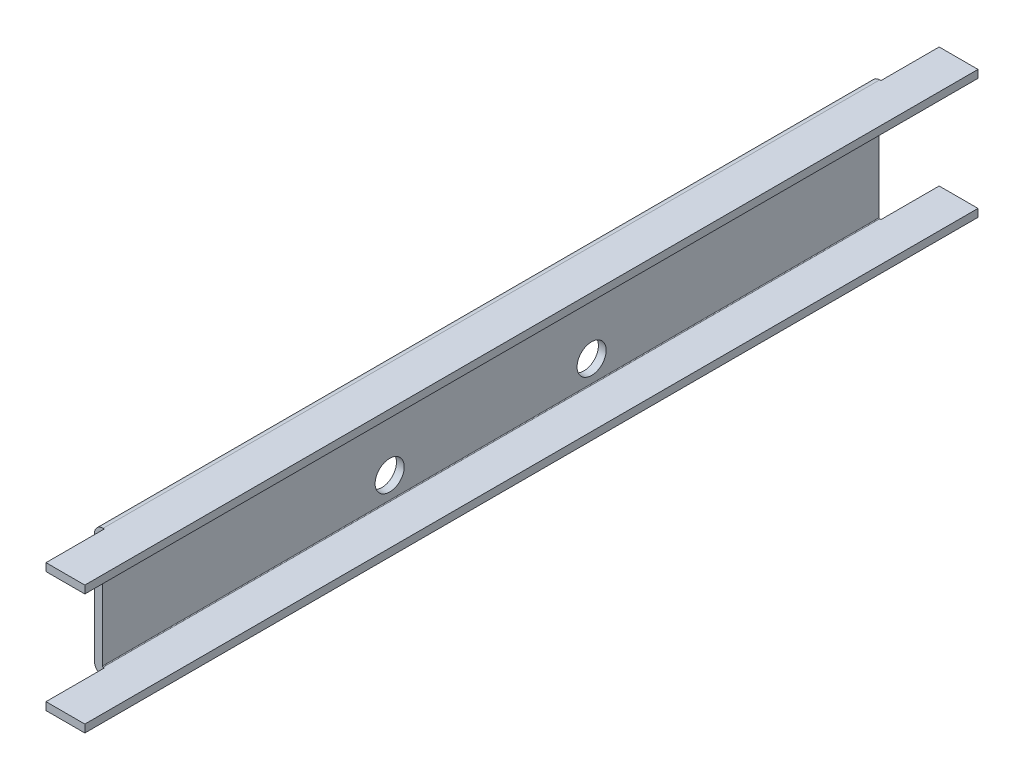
ISO-10303-21;
HEADER;
FILE_DESCRIPTION(('STEP AP214'),'2;1');
FILE_NAME('part.step','',(''),(''),'','','');
FILE_SCHEMA(('AUTOMOTIVE_DESIGN { 1 0 10303 214 1 1 1 1 }'));
ENDSEC;
DATA;
#1=APPLICATION_CONTEXT('core data for automotive mechanical design processes');
#2=APPLICATION_PROTOCOL_DEFINITION('international standard','automotive_design',2000,#1);
#3=PRODUCT_CONTEXT('',#1,'mechanical');
#4=PRODUCT('Part','Part','',(#3));
#5=PRODUCT_RELATED_PRODUCT_CATEGORY('part','',(#4));
#6=PRODUCT_DEFINITION_FORMATION('','',#4);
#7=PRODUCT_DEFINITION_CONTEXT('part definition',#1,'design');
#8=PRODUCT_DEFINITION('design','',#6,#7);
#9=PRODUCT_DEFINITION_SHAPE('','',#8);
#10=(LENGTH_UNIT() NAMED_UNIT(*) SI_UNIT(.MILLI.,.METRE.));
#11=(NAMED_UNIT(*) PLANE_ANGLE_UNIT() SI_UNIT($,.RADIAN.));
#12=(NAMED_UNIT(*) SI_UNIT($,.STERADIAN.) SOLID_ANGLE_UNIT());
#13=UNCERTAINTY_MEASURE_WITH_UNIT(LENGTH_MEASURE(1.E-05),#10,'distance_accuracy_value','');
#14=(GEOMETRIC_REPRESENTATION_CONTEXT(3) GLOBAL_UNCERTAINTY_ASSIGNED_CONTEXT((#13)) GLOBAL_UNIT_ASSIGNED_CONTEXT((#10,
#11,#12)) REPRESENTATION_CONTEXT('',''));
#15=CARTESIAN_POINT('',(0.,0.,0.));
#16=DIRECTION('',(0.,0.,1.));
#17=DIRECTION('',(1.,0.,0.));
#18=AXIS2_PLACEMENT_3D('',#15,#16,#17);
#19=CARTESIAN_POINT('',(-8.,57.2634,-460.));
#20=DIRECTION('',(0.,0.,-1.));
#21=DIRECTION('',(-1.,0.,0.));
#22=AXIS2_PLACEMENT_3D('',#19,#20,#21);
#23=PLANE('',#22);
#24=DIRECTION('',(-1.,0.,0.));
#25=VECTOR('',#24,1.);
#26=CARTESIAN_POINT('',(42.,58.,-460.));
#27=LINE('',#26,#25);
#28=CARTESIAN_POINT('',(42.,58.,-460.));
#29=VERTEX_POINT('',#28);
#30=CARTESIAN_POINT('',(2.,58.,-460.));
#31=VERTEX_POINT('',#30);
#32=EDGE_CURVE('E288',#29,#31,#27,.T.);
#33=ORIENTED_EDGE('',*,*,#32,.T.);
#34=DIRECTION('',(0.,1.,0.));
#35=VECTOR('',#34,1.);
#36=CARTESIAN_POINT('',(2.,57.2634,-460.));
#37=LINE('',#36,#35);
#38=CARTESIAN_POINT('',(2.,66.,-460.));
#39=VERTEX_POINT('',#38);
#40=EDGE_CURVE('E207',#31,#39,#37,.T.);
#41=ORIENTED_EDGE('',*,*,#40,.T.);
#42=DIRECTION('',(-1.,0.,0.));
#43=VECTOR('',#42,1.);
#44=CARTESIAN_POINT('',(42.,66.,-460.));
#45=LINE('',#44,#43);
#46=CARTESIAN_POINT('',(42.,66.,-460.));
#47=VERTEX_POINT('',#46);
#48=EDGE_CURVE('E294',#47,#39,#45,.T.);
#49=ORIENTED_EDGE('',*,*,#48,.F.);
#50=DIRECTION('',(0.,-1.,0.));
#51=VECTOR('',#50,1.);
#52=CARTESIAN_POINT('',(42.,66.,-460.));
#53=LINE('',#52,#51);
#54=EDGE_CURVE('E291',#47,#29,#53,.T.);
#55=ORIENTED_EDGE('',*,*,#54,.T.);
#56=EDGE_LOOP('',(#33,#41,#49,#55));
#57=FACE_BOUND('',#56,.T.);
#58=ADVANCED_FACE('F43',(#57),#23,.T.);
#59=CARTESIAN_POINT('',(0.736600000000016,-57.2634,-460.));
#60=DIRECTION('',(0.,0.,-1.));
#61=DIRECTION('',(-1.,0.,0.));
#62=AXIS2_PLACEMENT_3D('',#59,#60,#61);
#63=PLANE('',#62);
#64=DIRECTION('',(1.,0.,0.));
#65=VECTOR('',#64,1.);
#66=CARTESIAN_POINT('',(0.,-66.,-460.));
#67=LINE('',#66,#65);
#68=CARTESIAN_POINT('',(2.00000000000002,-66.,-460.));
#69=VERTEX_POINT('',#68);
#70=CARTESIAN_POINT('',(42.,-66.,-460.));
#71=VERTEX_POINT('',#70);
#72=EDGE_CURVE('E281',#69,#71,#67,.T.);
#73=ORIENTED_EDGE('',*,*,#72,.F.);
#74=DIRECTION('',(0.,1.,0.));
#75=VECTOR('',#74,1.);
#76=CARTESIAN_POINT('',(2.00000000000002,-57.2634,-460.));
#77=LINE('',#76,#75);
#78=CARTESIAN_POINT('',(2.00000000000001,-58.,-460.));
#79=VERTEX_POINT('',#78);
#80=EDGE_CURVE('E50',#69,#79,#77,.T.);
#81=ORIENTED_EDGE('',*,*,#80,.T.);
#82=DIRECTION('',(1.,0.,0.));
#83=VECTOR('',#82,1.);
#84=CARTESIAN_POINT('',(0.,-58.,-460.));
#85=LINE('',#84,#83);
#86=CARTESIAN_POINT('',(42.,-58.,-460.));
#87=VERTEX_POINT('',#86);
#88=EDGE_CURVE('E286',#79,#87,#85,.T.);
#89=ORIENTED_EDGE('',*,*,#88,.T.);
#90=DIRECTION('',(0.,-1.,0.));
#91=VECTOR('',#90,1.);
#92=CARTESIAN_POINT('',(42.,-58.,-460.));
#93=LINE('',#92,#91);
#94=EDGE_CURVE('E283',#87,#71,#93,.T.);
#95=ORIENTED_EDGE('',*,*,#94,.T.);
#96=EDGE_LOOP('',(#73,#81,#89,#95));
#97=FACE_BOUND('',#96,.T.);
#98=ADVANCED_FACE('F351',(#97),#63,.T.);
#99=CARTESIAN_POINT('',(-7.99999999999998,-57.2633999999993,460.));
#100=DIRECTION('',(0.,0.,1.));
#101=DIRECTION('',(1.,0.,0.));
#102=AXIS2_PLACEMENT_3D('',#99,#100,#101);
#103=PLANE('',#102);
#104=DIRECTION('',(0.,1.,0.));
#105=VECTOR('',#104,1.);
#106=CARTESIAN_POINT('',(2.00000000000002,-57.2633999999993,460.));
#107=LINE('',#106,#105);
#108=CARTESIAN_POINT('',(2.00000000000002,-66.,460.));
#109=VERTEX_POINT('',#108);
#110=CARTESIAN_POINT('',(2.00000000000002,-58.,460.));
#111=VERTEX_POINT('',#110);
#112=EDGE_CURVE('E234',#109,#111,#107,.T.);
#113=ORIENTED_EDGE('',*,*,#112,.F.);
#114=DIRECTION('',(1.,0.,0.));
#115=VECTOR('',#114,1.);
#116=CARTESIAN_POINT('',(0.,-66.,460.));
#117=LINE('',#116,#115);
#118=CARTESIAN_POINT('',(42.,-66.,460.));
#119=VERTEX_POINT('',#118);
#120=EDGE_CURVE('E297',#109,#119,#117,.T.);
#121=ORIENTED_EDGE('',*,*,#120,.T.);
#122=DIRECTION('',(0.,-1.,0.));
#123=VECTOR('',#122,1.);
#124=CARTESIAN_POINT('',(42.,-58.,460.));
#125=LINE('',#124,#123);
#126=CARTESIAN_POINT('',(42.,-58.,460.));
#127=VERTEX_POINT('',#126);
#128=EDGE_CURVE('E299',#127,#119,#125,.T.);
#129=ORIENTED_EDGE('',*,*,#128,.F.);
#130=DIRECTION('',(1.,0.,0.));
#131=VECTOR('',#130,1.);
#132=CARTESIAN_POINT('',(0.,-58.,460.));
#133=LINE('',#132,#131);
#134=EDGE_CURVE('E302',#111,#127,#133,.T.);
#135=ORIENTED_EDGE('',*,*,#134,.F.);
#136=EDGE_LOOP('',(#113,#121,#129,#135));
#137=FACE_BOUND('',#136,.T.);
#138=ADVANCED_FACE('F365',(#137),#103,.T.);
#139=CARTESIAN_POINT('',(0.,-66.,460.));
#140=DIRECTION('',(0.,1.,0.));
#141=DIRECTION('',(0.,0.,1.));
#142=AXIS2_PLACEMENT_3D('',#139,#140,#141);
#143=PLANE('',#142);
#144=DIRECTION('',(0.,0.,-1.));
#145=VECTOR('',#144,1.);
#146=CARTESIAN_POINT('',(0.736600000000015,-66.,460.));
#147=LINE('',#146,#145);
#148=CARTESIAN_POINT('',(0.736600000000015,-66.,400.));
#149=VERTEX_POINT('',#148);
#150=CARTESIAN_POINT('',(0.736600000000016,-66.,-400.));
#151=VERTEX_POINT('',#150);
#152=EDGE_CURVE('E199',#149,#151,#147,.T.);
#153=ORIENTED_EDGE('',*,*,#152,.T.);
#154=DIRECTION('',(1.,0.,0.));
#155=VECTOR('',#154,1.);
#156=CARTESIAN_POINT('',(0.,-66.,-400.));
#157=LINE('',#156,#155);
#158=CARTESIAN_POINT('',(2.00000000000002,-66.,-400.));
#159=VERTEX_POINT('',#158);
#160=EDGE_CURVE('E190',#151,#159,#157,.T.);
#161=ORIENTED_EDGE('',*,*,#160,.T.);
#162=DIRECTION('',(0.,0.,1.));
#163=VECTOR('',#162,1.);
#164=CARTESIAN_POINT('',(2.00000000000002,-66.,460.));
#165=LINE('',#164,#163);
#166=EDGE_CURVE('E179',#69,#159,#165,.T.);
#167=ORIENTED_EDGE('',*,*,#166,.F.);
#168=ORIENTED_EDGE('',*,*,#72,.T.);
#169=DIRECTION('',(0.,0.,-1.));
#170=VECTOR('',#169,1.);
#171=CARTESIAN_POINT('',(42.,-66.,460.));
#172=LINE('',#171,#170);
#173=EDGE_CURVE('E342',#119,#71,#172,.T.);
#174=ORIENTED_EDGE('',*,*,#173,.F.);
#175=ORIENTED_EDGE('',*,*,#120,.F.);
#176=DIRECTION('',(0.,0.,-1.));
#177=VECTOR('',#176,1.);
#178=CARTESIAN_POINT('',(2.00000000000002,-66.,460.));
#179=LINE('',#178,#177);
#180=CARTESIAN_POINT('',(2.00000000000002,-66.,400.));
#181=VERTEX_POINT('',#180);
#182=EDGE_CURVE('E236',#109,#181,#179,.T.);
#183=ORIENTED_EDGE('',*,*,#182,.T.);
#184=DIRECTION('',(-1.,0.,0.));
#185=VECTOR('',#184,1.);
#186=CARTESIAN_POINT('',(0.,-66.,400.));
#187=LINE('',#186,#185);
#188=EDGE_CURVE('E239',#181,#149,#187,.T.);
#189=ORIENTED_EDGE('',*,*,#188,.T.);
#190=EDGE_LOOP('',(#153,#161,#167,#168,#174,#175,#183,#189));
#191=FACE_BOUND('',#190,.T.);
#192=ADVANCED_FACE('F196',(#191),#143,.F.);
#193=CARTESIAN_POINT('',(42.,-58.,460.));
#194=DIRECTION('',(1.,0.,0.));
#195=DIRECTION('',(0.,0.,-1.));
#196=AXIS2_PLACEMENT_3D('',#193,#194,#195);
#197=PLANE('',#196);
#198=ORIENTED_EDGE('',*,*,#94,.F.);
#199=DIRECTION('',(0.,0.,-1.));
#200=VECTOR('',#199,1.);
#201=CARTESIAN_POINT('',(42.,-58.,460.));
#202=LINE('',#201,#200);
#203=EDGE_CURVE('E339',#127,#87,#202,.T.);
#204=ORIENTED_EDGE('',*,*,#203,.F.);
#205=ORIENTED_EDGE('',*,*,#128,.T.);
#206=ORIENTED_EDGE('',*,*,#173,.T.);
#207=EDGE_LOOP('',(#198,#204,#205,#206));
#208=FACE_BOUND('',#207,.T.);
#209=ADVANCED_FACE('F360',(#208),#197,.T.);
#210=CARTESIAN_POINT('',(0.,-58.,460.));
#211=DIRECTION('',(0.,1.,0.));
#212=DIRECTION('',(0.,0.,1.));
#213=AXIS2_PLACEMENT_3D('',#210,#211,#212);
#214=PLANE('',#213);
#215=DIRECTION('',(1.,0.,0.));
#216=VECTOR('',#215,1.);
#217=CARTESIAN_POINT('',(0.,-58.,-400.));
#218=LINE('',#217,#216);
#219=CARTESIAN_POINT('',(0.736600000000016,-58.,-400.));
#220=VERTEX_POINT('',#219);
#221=CARTESIAN_POINT('',(2.00000000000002,-58.,-400.));
#222=VERTEX_POINT('',#221);
#223=EDGE_CURVE('E192',#220,#222,#218,.T.);
#224=ORIENTED_EDGE('',*,*,#223,.F.);
#225=DIRECTION('',(0.,0.,-1.));
#226=VECTOR('',#225,1.);
#227=CARTESIAN_POINT('',(0.736600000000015,-58.,460.));
#228=LINE('',#227,#226);
#229=CARTESIAN_POINT('',(0.736600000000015,-58.,400.));
#230=VERTEX_POINT('',#229);
#231=EDGE_CURVE('E336',#230,#220,#228,.T.);
#232=ORIENTED_EDGE('',*,*,#231,.F.);
#233=DIRECTION('',(-1.,0.,0.));
#234=VECTOR('',#233,1.);
#235=CARTESIAN_POINT('',(0.,-58.,400.));
#236=LINE('',#235,#234);
#237=CARTESIAN_POINT('',(2.00000000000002,-58.,400.));
#238=VERTEX_POINT('',#237);
#239=EDGE_CURVE('E255',#238,#230,#236,.T.);
#240=ORIENTED_EDGE('',*,*,#239,.F.);
#241=DIRECTION('',(0.,0.,-1.));
#242=VECTOR('',#241,1.);
#243=CARTESIAN_POINT('',(2.00000000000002,-58.,460.));
#244=LINE('',#243,#242);
#245=EDGE_CURVE('E232',#111,#238,#244,.T.);
#246=ORIENTED_EDGE('',*,*,#245,.F.);
#247=ORIENTED_EDGE('',*,*,#134,.T.);
#248=ORIENTED_EDGE('',*,*,#203,.T.);
#249=ORIENTED_EDGE('',*,*,#88,.F.);
#250=DIRECTION('',(0.,0.,1.));
#251=VECTOR('',#250,1.);
#252=CARTESIAN_POINT('',(2.00000000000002,-58.,460.));
#253=LINE('',#252,#251);
#254=EDGE_CURVE('E57',#79,#222,#253,.T.);
#255=ORIENTED_EDGE('',*,*,#254,.T.);
#256=EDGE_LOOP('',(#224,#232,#240,#246,#247,#248,#249,#255));
#257=FACE_BOUND('',#256,.T.);
#258=ADVANCED_FACE('F353',(#257),#214,.T.);
#259=CARTESIAN_POINT('',(0.736600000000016,-57.2634,460.));
#260=DIRECTION('',(0.,0.,-1.));
#261=DIRECTION('',(-1.,0.,0.));
#262=AXIS2_PLACEMENT_3D('',#259,#260,#261);
#263=CYLINDRICAL_SURFACE('',#262,0.7366);
#264=CARTESIAN_POINT('',(0.736600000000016,-57.2634,-400.));
#265=DIRECTION('',(0.,0.,1.));
#266=DIRECTION('',(0.,-1.,0.));
#267=AXIS2_PLACEMENT_3D('',#264,#265,#266);
#268=CIRCLE('',#267,0.7366);
#269=CARTESIAN_POINT('',(0.,-57.2633999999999,-400.));
#270=VERTEX_POINT('',#269);
#271=EDGE_CURVE('E219',#270,#220,#268,.T.);
#272=ORIENTED_EDGE('',*,*,#271,.F.);
#273=DIRECTION('',(0.,0.,-1.));
#274=VECTOR('',#273,1.);
#275=CARTESIAN_POINT('',(0.,-57.2633999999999,460.));
#276=LINE('',#275,#274);
#277=CARTESIAN_POINT('',(0.,-57.2633999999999,400.));
#278=VERTEX_POINT('',#277);
#279=EDGE_CURVE('E333',#278,#270,#276,.T.);
#280=ORIENTED_EDGE('',*,*,#279,.F.);
#281=CARTESIAN_POINT('',(0.736600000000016,-57.2634,400.));
#282=DIRECTION('',(0.,0.,-1.));
#283=DIRECTION('',(0.,1.,0.));
#284=AXIS2_PLACEMENT_3D('',#281,#282,#283);
#285=CIRCLE('',#284,0.7366);
#286=EDGE_CURVE('E253',#230,#278,#285,.T.);
#287=ORIENTED_EDGE('',*,*,#286,.F.);
#288=ORIENTED_EDGE('',*,*,#231,.T.);
#289=EDGE_LOOP('',(#272,#280,#287,#288));
#290=FACE_BOUND('',#289,.T.);
#291=ADVANCED_FACE('F378',(#290),#263,.F.);
#292=CARTESIAN_POINT('',(0.,58.,460.));
#293=DIRECTION('',(1.,0.,0.));
#294=DIRECTION('',(0.,1.,0.));
#295=AXIS2_PLACEMENT_3D('',#292,#293,#294);
#296=PLANE('',#295);
#297=DIRECTION('',(0.,-1.,0.));
#298=VECTOR('',#297,1.);
#299=CARTESIAN_POINT('',(0.,57.9999999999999,-400.));
#300=LINE('',#299,#298);
#301=CARTESIAN_POINT('',(0.,57.2634,-400.));
#302=VERTEX_POINT('',#301);
#303=EDGE_CURVE('E217',#302,#270,#300,.T.);
#304=ORIENTED_EDGE('',*,*,#303,.F.);
#305=DIRECTION('',(0.,0.,-1.));
#306=VECTOR('',#305,1.);
#307=CARTESIAN_POINT('',(0.,57.2634,460.));
#308=LINE('',#307,#306);
#309=CARTESIAN_POINT('',(0.,57.2634,400.));
#310=VERTEX_POINT('',#309);
#311=EDGE_CURVE('E330',#310,#302,#308,.T.);
#312=ORIENTED_EDGE('',*,*,#311,.F.);
#313=DIRECTION('',(0.,1.,0.));
#314=VECTOR('',#313,1.);
#315=CARTESIAN_POINT('',(0.,58.,400.));
#316=LINE('',#315,#314);
#317=EDGE_CURVE('E251',#278,#310,#316,.T.);
#318=ORIENTED_EDGE('',*,*,#317,.F.);
#319=ORIENTED_EDGE('',*,*,#279,.T.);
#320=EDGE_LOOP('',(#304,#312,#318,#319));
#321=FACE_BOUND('',#320,.T.);
#322=CARTESIAN_POINT('',(0.,-35.0000000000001,-104.));
#323=DIRECTION('',(1.,0.,0.));
#324=DIRECTION('',(0.,1.,0.));
#325=AXIS2_PLACEMENT_3D('',#322,#323,#324);
#326=CIRCLE('',#325,15.);
#327=CARTESIAN_POINT('',(0.,-20.0000000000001,-104.));
#328=VERTEX_POINT('',#327);
#329=EDGE_CURVE('E260',#328,#328,#326,.T.);
#330=ORIENTED_EDGE('',*,*,#329,.F.);
#331=EDGE_LOOP('',(#330));
#332=FACE_BOUND('',#331,.T.);
#333=CARTESIAN_POINT('',(0.,35.,-104.));
#334=DIRECTION('',(1.,0.,0.));
#335=DIRECTION('',(0.,1.,0.));
#336=AXIS2_PLACEMENT_3D('',#333,#334,#335);
#337=CIRCLE('',#336,15.);
#338=CARTESIAN_POINT('',(0.,50.,-104.));
#339=VERTEX_POINT('',#338);
#340=EDGE_CURVE('E266',#339,#339,#337,.T.);
#341=ORIENTED_EDGE('',*,*,#340,.F.);
#342=EDGE_LOOP('',(#341));
#343=FACE_BOUND('',#342,.T.);
#344=CARTESIAN_POINT('',(0.,-35.,104.));
#345=DIRECTION('',(1.,0.,0.));
#346=DIRECTION('',(0.,1.,0.));
#347=AXIS2_PLACEMENT_3D('',#344,#345,#346);
#348=CIRCLE('',#347,15.);
#349=CARTESIAN_POINT('',(0.,-20.,104.));
#350=VERTEX_POINT('',#349);
#351=EDGE_CURVE('E272',#350,#350,#348,.T.);
#352=ORIENTED_EDGE('',*,*,#351,.F.);
#353=EDGE_LOOP('',(#352));
#354=FACE_BOUND('',#353,.T.);
#355=CARTESIAN_POINT('',(0.,35.,104.));
#356=DIRECTION('',(1.,0.,0.));
#357=DIRECTION('',(0.,1.,0.));
#358=AXIS2_PLACEMENT_3D('',#355,#356,#357);
#359=CIRCLE('',#358,15.);
#360=CARTESIAN_POINT('',(0.,50.,104.));
#361=VERTEX_POINT('',#360);
#362=EDGE_CURVE('E278',#361,#361,#359,.T.);
#363=ORIENTED_EDGE('',*,*,#362,.F.);
#364=EDGE_LOOP('',(#363));
#365=FACE_BOUND('',#364,.T.);
#366=ADVANCED_FACE('F381',(#321,#332,#343,#354,#365),#296,.T.);
#367=CARTESIAN_POINT('',(0.73660000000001,57.2634,460.));
#368=DIRECTION('',(0.,0.,-1.));
#369=DIRECTION('',(-1.,0.,0.));
#370=AXIS2_PLACEMENT_3D('',#367,#368,#369);
#371=CYLINDRICAL_SURFACE('',#370,0.7366);
#372=CARTESIAN_POINT('',(0.73660000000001,57.2634,-400.));
#373=DIRECTION('',(0.,0.,1.));
#374=DIRECTION('',(0.,-1.,0.));
#375=AXIS2_PLACEMENT_3D('',#372,#373,#374);
#376=CIRCLE('',#375,0.7366);
#377=CARTESIAN_POINT('',(0.736600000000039,58.,-400.));
#378=VERTEX_POINT('',#377);
#379=EDGE_CURVE('E215',#378,#302,#376,.T.);
#380=ORIENTED_EDGE('',*,*,#379,.F.);
#381=DIRECTION('',(0.,0.,-1.));
#382=VECTOR('',#381,1.);
#383=CARTESIAN_POINT('',(0.736600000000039,58.,460.));
#384=LINE('',#383,#382);
#385=CARTESIAN_POINT('',(0.736600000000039,58.,400.));
#386=VERTEX_POINT('',#385);
#387=EDGE_CURVE('E327',#386,#378,#384,.T.);
#388=ORIENTED_EDGE('',*,*,#387,.F.);
#389=CARTESIAN_POINT('',(0.73660000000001,57.2634,400.));
#390=DIRECTION('',(0.,0.,-1.));
#391=DIRECTION('',(0.,1.,0.));
#392=AXIS2_PLACEMENT_3D('',#389,#390,#391);
#393=CIRCLE('',#392,0.7366);
#394=EDGE_CURVE('E249',#310,#386,#393,.T.);
#395=ORIENTED_EDGE('',*,*,#394,.F.);
#396=ORIENTED_EDGE('',*,*,#311,.T.);
#397=EDGE_LOOP('',(#380,#388,#395,#396));
#398=FACE_BOUND('',#397,.T.);
#399=ADVANCED_FACE('F389',(#398),#371,.F.);
#400=CARTESIAN_POINT('',(42.,58.,460.));
#401=DIRECTION('',(0.,-1.,0.));
#402=DIRECTION('',(1.,0.,0.));
#403=AXIS2_PLACEMENT_3D('',#400,#401,#402);
#404=PLANE('',#403);
#405=DIRECTION('',(-1.,0.,0.));
#406=VECTOR('',#405,1.);
#407=CARTESIAN_POINT('',(42.,58.,-400.));
#408=LINE('',#407,#406);
#409=CARTESIAN_POINT('',(2.,58.,-400.));
#410=VERTEX_POINT('',#409);
#411=EDGE_CURVE('E213',#410,#378,#408,.T.);
#412=ORIENTED_EDGE('',*,*,#411,.F.);
#413=DIRECTION('',(0.,0.,-1.));
#414=VECTOR('',#413,1.);
#415=CARTESIAN_POINT('',(2.,58.,460.));
#416=LINE('',#415,#414);
#417=EDGE_CURVE('E201',#410,#31,#416,.T.);
#418=ORIENTED_EDGE('',*,*,#417,.T.);
#419=ORIENTED_EDGE('',*,*,#32,.F.);
#420=DIRECTION('',(0.,0.,-1.));
#421=VECTOR('',#420,1.);
#422=CARTESIAN_POINT('',(42.,58.,460.));
#423=LINE('',#422,#421);
#424=CARTESIAN_POINT('',(42.,58.,460.));
#425=VERTEX_POINT('',#424);
#426=EDGE_CURVE('E325',#425,#29,#423,.T.);
#427=ORIENTED_EDGE('',*,*,#426,.F.);
#428=DIRECTION('',(-1.,0.,0.));
#429=VECTOR('',#428,1.);
#430=CARTESIAN_POINT('',(42.,58.,460.));
#431=LINE('',#430,#429);
#432=CARTESIAN_POINT('',(2.00000000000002,58.,460.));
#433=VERTEX_POINT('',#432);
#434=EDGE_CURVE('E304',#425,#433,#431,.T.);
#435=ORIENTED_EDGE('',*,*,#434,.T.);
#436=DIRECTION('',(0.,0.,1.));
#437=VECTOR('',#436,1.);
#438=CARTESIAN_POINT('',(2.,58.,460.));
#439=LINE('',#438,#437);
#440=CARTESIAN_POINT('',(2.,58.,400.));
#441=VERTEX_POINT('',#440);
#442=EDGE_CURVE('E65',#441,#433,#439,.T.);
#443=ORIENTED_EDGE('',*,*,#442,.F.);
#444=DIRECTION('',(1.,0.,0.));
#445=VECTOR('',#444,1.);
#446=CARTESIAN_POINT('',(42.,58.,400.));
#447=LINE('',#446,#445);
#448=EDGE_CURVE('E247',#386,#441,#447,.T.);
#449=ORIENTED_EDGE('',*,*,#448,.F.);
#450=ORIENTED_EDGE('',*,*,#387,.T.);
#451=EDGE_LOOP('',(#412,#418,#419,#427,#435,#443,#449,#450));
#452=FACE_BOUND('',#451,.T.);
#453=ADVANCED_FACE('F392',(#452),#404,.T.);
#454=CARTESIAN_POINT('',(42.,66.,460.));
#455=DIRECTION('',(1.,0.,0.));
#456=DIRECTION('',(0.,0.,-1.));
#457=AXIS2_PLACEMENT_3D('',#454,#455,#456);
#458=PLANE('',#457);
#459=ORIENTED_EDGE('',*,*,#54,.F.);
#460=DIRECTION('',(0.,0.,-1.));
#461=VECTOR('',#460,1.);
#462=CARTESIAN_POINT('',(42.,66.,460.));
#463=LINE('',#462,#461);
#464=CARTESIAN_POINT('',(42.,66.,460.));
#465=VERTEX_POINT('',#464);
#466=EDGE_CURVE('E323',#465,#47,#463,.T.);
#467=ORIENTED_EDGE('',*,*,#466,.F.);
#468=DIRECTION('',(0.,-1.,0.));
#469=VECTOR('',#468,1.);
#470=CARTESIAN_POINT('',(42.,66.,460.));
#471=LINE('',#470,#469);
#472=EDGE_CURVE('E307',#465,#425,#471,.T.);
#473=ORIENTED_EDGE('',*,*,#472,.T.);
#474=ORIENTED_EDGE('',*,*,#426,.T.);
#475=EDGE_LOOP('',(#459,#467,#473,#474));
#476=FACE_BOUND('',#475,.T.);
#477=ADVANCED_FACE('F406',(#476),#458,.T.);
#478=CARTESIAN_POINT('',(42.,66.,460.));
#479=DIRECTION('',(0.,-1.,0.));
#480=DIRECTION('',(1.,0.,0.));
#481=AXIS2_PLACEMENT_3D('',#478,#479,#480);
#482=PLANE('',#481);
#483=DIRECTION('',(0.,0.,-1.));
#484=VECTOR('',#483,1.);
#485=CARTESIAN_POINT('',(2.,66.,460.));
#486=LINE('',#485,#484);
#487=CARTESIAN_POINT('',(2.,66.,-400.));
#488=VERTEX_POINT('',#487);
#489=EDGE_CURVE('E186',#488,#39,#486,.T.);
#490=ORIENTED_EDGE('',*,*,#489,.F.);
#491=DIRECTION('',(-1.,0.,0.));
#492=VECTOR('',#491,1.);
#493=CARTESIAN_POINT('',(42.,66.,-400.));
#494=LINE('',#493,#492);
#495=CARTESIAN_POINT('',(0.736600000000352,66.,-400.));
#496=VERTEX_POINT('',#495);
#497=EDGE_CURVE('E204',#488,#496,#494,.T.);
#498=ORIENTED_EDGE('',*,*,#497,.T.);
#499=DIRECTION('',(0.,0.,-1.));
#500=VECTOR('',#499,1.);
#501=CARTESIAN_POINT('',(0.736600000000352,66.,460.));
#502=LINE('',#501,#500);
#503=CARTESIAN_POINT('',(0.73660000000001,66.,400.));
#504=VERTEX_POINT('',#503);
#505=EDGE_CURVE('E320',#504,#496,#502,.T.);
#506=ORIENTED_EDGE('',*,*,#505,.F.);
#507=DIRECTION('',(1.,0.,0.));
#508=VECTOR('',#507,1.);
#509=CARTESIAN_POINT('',(42.,66.,400.));
#510=LINE('',#509,#508);
#511=CARTESIAN_POINT('',(2.,66.,400.));
#512=VERTEX_POINT('',#511);
#513=EDGE_CURVE('E244',#504,#512,#510,.T.);
#514=ORIENTED_EDGE('',*,*,#513,.T.);
#515=DIRECTION('',(0.,0.,1.));
#516=VECTOR('',#515,1.);
#517=CARTESIAN_POINT('',(2.,66.,460.));
#518=LINE('',#517,#516);
#519=CARTESIAN_POINT('',(2.,66.,460.));
#520=VERTEX_POINT('',#519);
#521=EDGE_CURVE('E228',#512,#520,#518,.T.);
#522=ORIENTED_EDGE('',*,*,#521,.T.);
#523=DIRECTION('',(-1.,0.,0.));
#524=VECTOR('',#523,1.);
#525=CARTESIAN_POINT('',(42.,66.,460.));
#526=LINE('',#525,#524);
#527=EDGE_CURVE('E310',#465,#520,#526,.T.);
#528=ORIENTED_EDGE('',*,*,#527,.F.);
#529=ORIENTED_EDGE('',*,*,#466,.T.);
#530=ORIENTED_EDGE('',*,*,#48,.T.);
#531=EDGE_LOOP('',(#490,#498,#506,#514,#522,#528,#529,#530));
#532=FACE_BOUND('',#531,.T.);
#533=ADVANCED_FACE('F398',(#532),#482,.F.);
#534=CARTESIAN_POINT('',(0.73660000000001,57.2634,460.));
#535=DIRECTION('',(0.,0.,-1.));
#536=DIRECTION('',(-1.,0.,0.));
#537=AXIS2_PLACEMENT_3D('',#534,#535,#536);
#538=CYLINDRICAL_SURFACE('',#537,8.7366);
#539=ORIENTED_EDGE('',*,*,#505,.T.);
#540=CARTESIAN_POINT('',(0.73660000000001,57.2634,-400.));
#541=DIRECTION('',(0.,0.,1.));
#542=DIRECTION('',(0.,-1.,0.));
#543=AXIS2_PLACEMENT_3D('',#540,#541,#542);
#544=CIRCLE('',#543,8.7366);
#545=CARTESIAN_POINT('',(-8.,57.2634,-400.));
#546=VERTEX_POINT('',#545);
#547=EDGE_CURVE('E200',#496,#546,#544,.T.);
#548=ORIENTED_EDGE('',*,*,#547,.T.);
#549=DIRECTION('',(0.,0.,-1.));
#550=VECTOR('',#549,1.);
#551=CARTESIAN_POINT('',(-8.,57.2634,460.));
#552=LINE('',#551,#550);
#553=CARTESIAN_POINT('',(-8.,57.2634,400.));
#554=VERTEX_POINT('',#553);
#555=EDGE_CURVE('E317',#554,#546,#552,.T.);
#556=ORIENTED_EDGE('',*,*,#555,.F.);
#557=CARTESIAN_POINT('',(0.73660000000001,57.2634,400.));
#558=DIRECTION('',(0.,0.,-1.));
#559=DIRECTION('',(0.,1.,0.));
#560=AXIS2_PLACEMENT_3D('',#557,#558,#559);
#561=CIRCLE('',#560,8.7366);
#562=EDGE_CURVE('E241',#554,#504,#561,.T.);
#563=ORIENTED_EDGE('',*,*,#562,.T.);
#564=EDGE_LOOP('',(#539,#548,#556,#563));
#565=FACE_BOUND('',#564,.T.);
#566=ADVANCED_FACE('F422',(#565),#538,.T.);
#567=CARTESIAN_POINT('',(-8.,58.,460.));
#568=DIRECTION('',(1.,0.,0.));
#569=DIRECTION('',(0.,1.,0.));
#570=AXIS2_PLACEMENT_3D('',#567,#568,#569);
#571=PLANE('',#570);
#572=CARTESIAN_POINT('',(-7.99999999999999,-35.0000000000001,-104.));
#573=DIRECTION('',(-1.,0.,0.));
#574=DIRECTION('',(0.,-1.,0.));
#575=AXIS2_PLACEMENT_3D('',#572,#573,#574);
#576=CIRCLE('',#575,15.);
#577=CARTESIAN_POINT('',(-7.99999999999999,-50.0000000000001,-104.));
#578=VERTEX_POINT('',#577);
#579=EDGE_CURVE('E257',#578,#578,#576,.T.);
#580=ORIENTED_EDGE('',*,*,#579,.F.);
#581=EDGE_LOOP('',(#580));
#582=FACE_BOUND('',#581,.T.);
#583=CARTESIAN_POINT('',(-7.99999999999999,35.,-104.));
#584=DIRECTION('',(-1.,0.,0.));
#585=DIRECTION('',(0.,-1.,0.));
#586=AXIS2_PLACEMENT_3D('',#583,#584,#585);
#587=CIRCLE('',#586,15.);
#588=CARTESIAN_POINT('',(-7.99999999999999,20.,-104.));
#589=VERTEX_POINT('',#588);
#590=EDGE_CURVE('E263',#589,#589,#587,.T.);
#591=ORIENTED_EDGE('',*,*,#590,.F.);
#592=EDGE_LOOP('',(#591));
#593=FACE_BOUND('',#592,.T.);
#594=CARTESIAN_POINT('',(-7.99999999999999,-35.,104.));
#595=DIRECTION('',(-1.,0.,0.));
#596=DIRECTION('',(0.,-1.,0.));
#597=AXIS2_PLACEMENT_3D('',#594,#595,#596);
#598=CIRCLE('',#597,15.);
#599=CARTESIAN_POINT('',(-7.99999999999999,-50.,104.));
#600=VERTEX_POINT('',#599);
#601=EDGE_CURVE('E269',#600,#600,#598,.T.);
#602=ORIENTED_EDGE('',*,*,#601,.F.);
#603=EDGE_LOOP('',(#602));
#604=FACE_BOUND('',#603,.T.);
#605=CARTESIAN_POINT('',(-7.99999999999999,35.,104.));
#606=DIRECTION('',(-1.,0.,0.));
#607=DIRECTION('',(0.,-1.,0.));
#608=AXIS2_PLACEMENT_3D('',#605,#606,#607);
#609=CIRCLE('',#608,15.);
#610=CARTESIAN_POINT('',(-7.99999999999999,20.,104.));
#611=VERTEX_POINT('',#610);
#612=EDGE_CURVE('E275',#611,#611,#609,.T.);
#613=ORIENTED_EDGE('',*,*,#612,.F.);
#614=EDGE_LOOP('',(#613));
#615=FACE_BOUND('',#614,.T.);
#616=ORIENTED_EDGE('',*,*,#555,.T.);
#617=DIRECTION('',(0.,1.,0.));
#618=VECTOR('',#617,1.);
#619=CARTESIAN_POINT('',(-8.00000000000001,141.271204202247,-400.));
#620=LINE('',#619,#618);
#621=CARTESIAN_POINT('',(-7.99999999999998,-57.2634,-400.));
#622=VERTEX_POINT('',#621);
#623=EDGE_CURVE('E416',#622,#546,#620,.T.);
#624=ORIENTED_EDGE('',*,*,#623,.F.);
#625=DIRECTION('',(0.,0.,-1.));
#626=VECTOR('',#625,1.);
#627=CARTESIAN_POINT('',(-7.99999999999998,-57.2633999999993,460.));
#628=LINE('',#627,#626);
#629=CARTESIAN_POINT('',(-7.99999999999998,-57.2634,400.));
#630=VERTEX_POINT('',#629);
#631=EDGE_CURVE('E314',#630,#622,#628,.T.);
#632=ORIENTED_EDGE('',*,*,#631,.F.);
#633=DIRECTION('',(0.,-1.,0.));
#634=VECTOR('',#633,1.);
#635=CARTESIAN_POINT('',(-8.00000000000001,125.064904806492,400.));
#636=LINE('',#635,#634);
#637=EDGE_CURVE('E222',#554,#630,#636,.T.);
#638=ORIENTED_EDGE('',*,*,#637,.F.);
#639=EDGE_LOOP('',(#616,#624,#632,#638));
#640=FACE_BOUND('',#639,.T.);
#641=ADVANCED_FACE('F424',(#582,#593,#604,#615,#640),#571,.F.);
#642=CARTESIAN_POINT('',(0.736600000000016,-57.2634,460.));
#643=DIRECTION('',(0.,0.,-1.));
#644=DIRECTION('',(-1.,0.,0.));
#645=AXIS2_PLACEMENT_3D('',#642,#643,#644);
#646=CYLINDRICAL_SURFACE('',#645,8.7366);
#647=ORIENTED_EDGE('',*,*,#631,.T.);
#648=CARTESIAN_POINT('',(0.736600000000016,-57.2634,-400.));
#649=DIRECTION('',(0.,0.,1.));
#650=DIRECTION('',(0.,-1.,0.));
#651=AXIS2_PLACEMENT_3D('',#648,#649,#650);
#652=CIRCLE('',#651,8.7366);
#653=EDGE_CURVE('E11',#622,#151,#652,.T.);
#654=ORIENTED_EDGE('',*,*,#653,.T.);
#655=ORIENTED_EDGE('',*,*,#152,.F.);
#656=CARTESIAN_POINT('',(0.736600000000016,-57.2634,400.));
#657=DIRECTION('',(0.,0.,-1.));
#658=DIRECTION('',(0.,1.,0.));
#659=AXIS2_PLACEMENT_3D('',#656,#657,#658);
#660=CIRCLE('',#659,8.7366);
#661=EDGE_CURVE('E347',#149,#630,#660,.T.);
#662=ORIENTED_EDGE('',*,*,#661,.T.);
#663=EDGE_LOOP('',(#647,#654,#655,#662));
#664=FACE_BOUND('',#663,.T.);
#665=ADVANCED_FACE('F426',(#664),#646,.T.);
#666=CARTESIAN_POINT('',(0.736600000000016,-57.2634,460.));
#667=DIRECTION('',(0.,0.,-1.));
#668=DIRECTION('',(-1.,0.,0.));
#669=AXIS2_PLACEMENT_3D('',#666,#667,#668);
#670=PLANE('',#669);
#671=ORIENTED_EDGE('',*,*,#527,.T.);
#672=DIRECTION('',(0.,-1.,0.));
#673=VECTOR('',#672,1.);
#674=CARTESIAN_POINT('',(2.00000000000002,-57.2634,460.));
#675=LINE('',#674,#673);
#676=EDGE_CURVE('E345',#520,#433,#675,.T.);
#677=ORIENTED_EDGE('',*,*,#676,.T.);
#678=ORIENTED_EDGE('',*,*,#434,.F.);
#679=ORIENTED_EDGE('',*,*,#472,.F.);
#680=EDGE_LOOP('',(#671,#677,#678,#679));
#681=FACE_BOUND('',#680,.T.);
#682=ADVANCED_FACE('F402',(#681),#670,.F.);
#683=CARTESIAN_POINT('',(2.00000000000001,35.,104.));
#684=DIRECTION('',(-1.,0.,0.));
#685=DIRECTION('',(0.,-1.,0.));
#686=AXIS2_PLACEMENT_3D('',#683,#684,#685);
#687=CYLINDRICAL_SURFACE('',#686,15.);
#688=ORIENTED_EDGE('',*,*,#362,.T.);
#689=EDGE_LOOP('',(#688));
#690=FACE_BOUND('',#689,.T.);
#691=ORIENTED_EDGE('',*,*,#612,.T.);
#692=EDGE_LOOP('',(#691));
#693=FACE_BOUND('',#692,.T.);
#694=ADVANCED_FACE('F433',(#690,#693),#687,.F.);
#695=CARTESIAN_POINT('',(2.00000000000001,-35.,104.));
#696=DIRECTION('',(-1.,0.,0.));
#697=DIRECTION('',(0.,-1.,0.));
#698=AXIS2_PLACEMENT_3D('',#695,#696,#697);
#699=CYLINDRICAL_SURFACE('',#698,15.);
#700=ORIENTED_EDGE('',*,*,#351,.T.);
#701=EDGE_LOOP('',(#700));
#702=FACE_BOUND('',#701,.T.);
#703=ORIENTED_EDGE('',*,*,#601,.T.);
#704=EDGE_LOOP('',(#703));
#705=FACE_BOUND('',#704,.T.);
#706=ADVANCED_FACE('F449',(#702,#705),#699,.F.);
#707=CARTESIAN_POINT('',(2.00000000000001,35.,-104.));
#708=DIRECTION('',(-1.,0.,0.));
#709=DIRECTION('',(0.,-1.,0.));
#710=AXIS2_PLACEMENT_3D('',#707,#708,#709);
#711=CYLINDRICAL_SURFACE('',#710,15.);
#712=ORIENTED_EDGE('',*,*,#340,.T.);
#713=EDGE_LOOP('',(#712));
#714=FACE_BOUND('',#713,.T.);
#715=ORIENTED_EDGE('',*,*,#590,.T.);
#716=EDGE_LOOP('',(#715));
#717=FACE_BOUND('',#716,.T.);
#718=ADVANCED_FACE('F453',(#714,#717),#711,.F.);
#719=CARTESIAN_POINT('',(2.00000000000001,-35.0000000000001,-104.));
#720=DIRECTION('',(-1.,0.,0.));
#721=DIRECTION('',(0.,-1.,0.));
#722=AXIS2_PLACEMENT_3D('',#719,#720,#721);
#723=CYLINDRICAL_SURFACE('',#722,15.);
#724=ORIENTED_EDGE('',*,*,#329,.T.);
#725=EDGE_LOOP('',(#724));
#726=FACE_BOUND('',#725,.T.);
#727=ORIENTED_EDGE('',*,*,#579,.T.);
#728=EDGE_LOOP('',(#727));
#729=FACE_BOUND('',#728,.T.);
#730=ADVANCED_FACE('F457',(#726,#729),#723,.F.);
#731=CARTESIAN_POINT('',(1.99999999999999,125.064904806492,400.));
#732=DIRECTION('',(0.,0.,-1.));
#733=DIRECTION('',(0.,1.,0.));
#734=AXIS2_PLACEMENT_3D('',#731,#732,#733);
#735=PLANE('',#734);
#736=ORIENTED_EDGE('',*,*,#239,.T.);
#737=ORIENTED_EDGE('',*,*,#286,.T.);
#738=ORIENTED_EDGE('',*,*,#317,.T.);
#739=ORIENTED_EDGE('',*,*,#394,.T.);
#740=ORIENTED_EDGE('',*,*,#448,.T.);
#741=DIRECTION('',(0.,-1.,0.));
#742=VECTOR('',#741,1.);
#743=CARTESIAN_POINT('',(1.99999999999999,125.064904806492,400.));
#744=LINE('',#743,#742);
#745=EDGE_CURVE('E227',#512,#441,#744,.T.);
#746=ORIENTED_EDGE('',*,*,#745,.F.);
#747=ORIENTED_EDGE('',*,*,#513,.F.);
#748=ORIENTED_EDGE('',*,*,#562,.F.);
#749=ORIENTED_EDGE('',*,*,#637,.T.);
#750=ORIENTED_EDGE('',*,*,#661,.F.);
#751=ORIENTED_EDGE('',*,*,#188,.F.);
#752=EDGE_CURVE('E224',#238,#181,#744,.T.);
#753=ORIENTED_EDGE('',*,*,#752,.F.);
#754=EDGE_LOOP('',(#736,#737,#738,#739,#740,#746,#747,#748,#749,#750,#751,#753));
#755=FACE_BOUND('',#754,.T.);
#756=ADVANCED_FACE('F373',(#755),#735,.F.);
#757=CARTESIAN_POINT('',(2.00000000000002,-129.122854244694,510.77443196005));
#758=DIRECTION('',(1.,0.,0.));
#759=DIRECTION('',(0.,1.,0.));
#760=AXIS2_PLACEMENT_3D('',#757,#758,#759);
#761=PLANE('',#760);
#762=ORIENTED_EDGE('',*,*,#112,.T.);
#763=ORIENTED_EDGE('',*,*,#245,.T.);
#764=ORIENTED_EDGE('',*,*,#752,.T.);
#765=ORIENTED_EDGE('',*,*,#182,.F.);
#766=EDGE_LOOP('',(#762,#763,#764,#765));
#767=FACE_BOUND('',#766,.T.);
#768=ADVANCED_FACE('F367',(#767),#761,.F.);
#769=ORIENTED_EDGE('',*,*,#442,.T.);
#770=ORIENTED_EDGE('',*,*,#676,.F.);
#771=ORIENTED_EDGE('',*,*,#521,.F.);
#772=ORIENTED_EDGE('',*,*,#745,.T.);
#773=EDGE_LOOP('',(#769,#770,#771,#772));
#774=FACE_BOUND('',#773,.T.);
#775=ADVANCED_FACE('F394',(#774),#761,.F.);
#776=CARTESIAN_POINT('',(1.99999999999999,141.271204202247,-400.));
#777=DIRECTION('',(0.,0.,1.));
#778=DIRECTION('',(0.,-1.,0.));
#779=AXIS2_PLACEMENT_3D('',#776,#777,#778);
#780=PLANE('',#779);
#781=ORIENTED_EDGE('',*,*,#223,.T.);
#782=DIRECTION('',(0.,1.,0.));
#783=VECTOR('',#782,1.);
#784=CARTESIAN_POINT('',(1.99999999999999,141.271204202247,-400.));
#785=LINE('',#784,#783);
#786=EDGE_CURVE('E182',#159,#222,#785,.T.);
#787=ORIENTED_EDGE('',*,*,#786,.F.);
#788=ORIENTED_EDGE('',*,*,#160,.F.);
#789=ORIENTED_EDGE('',*,*,#653,.F.);
#790=ORIENTED_EDGE('',*,*,#623,.T.);
#791=ORIENTED_EDGE('',*,*,#547,.F.);
#792=ORIENTED_EDGE('',*,*,#497,.F.);
#793=EDGE_CURVE('E193',#410,#488,#785,.T.);
#794=ORIENTED_EDGE('',*,*,#793,.F.);
#795=ORIENTED_EDGE('',*,*,#411,.T.);
#796=ORIENTED_EDGE('',*,*,#379,.T.);
#797=ORIENTED_EDGE('',*,*,#303,.T.);
#798=ORIENTED_EDGE('',*,*,#271,.T.);
#799=EDGE_LOOP('',(#781,#787,#788,#789,#790,#791,#792,#794,#795,#796,#797,#798));
#800=FACE_BOUND('',#799,.T.);
#801=ADVANCED_FACE('F189',(#800),#780,.F.);
#802=CARTESIAN_POINT('',(2.00000000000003,-176.619765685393,-588.683672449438));
#803=DIRECTION('',(-1.,0.,0.));
#804=DIRECTION('',(0.,-1.,0.));
#805=AXIS2_PLACEMENT_3D('',#802,#803,#804);
#806=PLANE('',#805);
#807=ORIENTED_EDGE('',*,*,#166,.T.);
#808=ORIENTED_EDGE('',*,*,#786,.T.);
#809=ORIENTED_EDGE('',*,*,#254,.F.);
#810=ORIENTED_EDGE('',*,*,#80,.F.);
#811=EDGE_LOOP('',(#807,#808,#809,#810));
#812=FACE_BOUND('',#811,.T.);
#813=ADVANCED_FACE('F181',(#812),#806,.T.);
#814=ORIENTED_EDGE('',*,*,#793,.T.);
#815=ORIENTED_EDGE('',*,*,#489,.T.);
#816=ORIENTED_EDGE('',*,*,#40,.F.);
#817=ORIENTED_EDGE('',*,*,#417,.F.);
#818=EDGE_LOOP('',(#814,#815,#816,#817));
#819=FACE_BOUND('',#818,.T.);
#820=ADVANCED_FACE('F467',(#819),#806,.T.);
#821=CLOSED_SHELL('',(#58,#98,#138,#192,#209,#258,#291,#366,#399,#453,#477,#533,#566,#641,#665,
#682,#694,#706,#718,#730,#756,#768,#775,#801,#813,#820));
#822=MANIFOLD_SOLID_BREP('B2',#821);
#823=ADVANCED_BREP_SHAPE_REPRESENTATION('',(#18,#822),#14);
#824=SHAPE_DEFINITION_REPRESENTATION(#9,#823);
ENDSEC;
END-ISO-10303-21;
